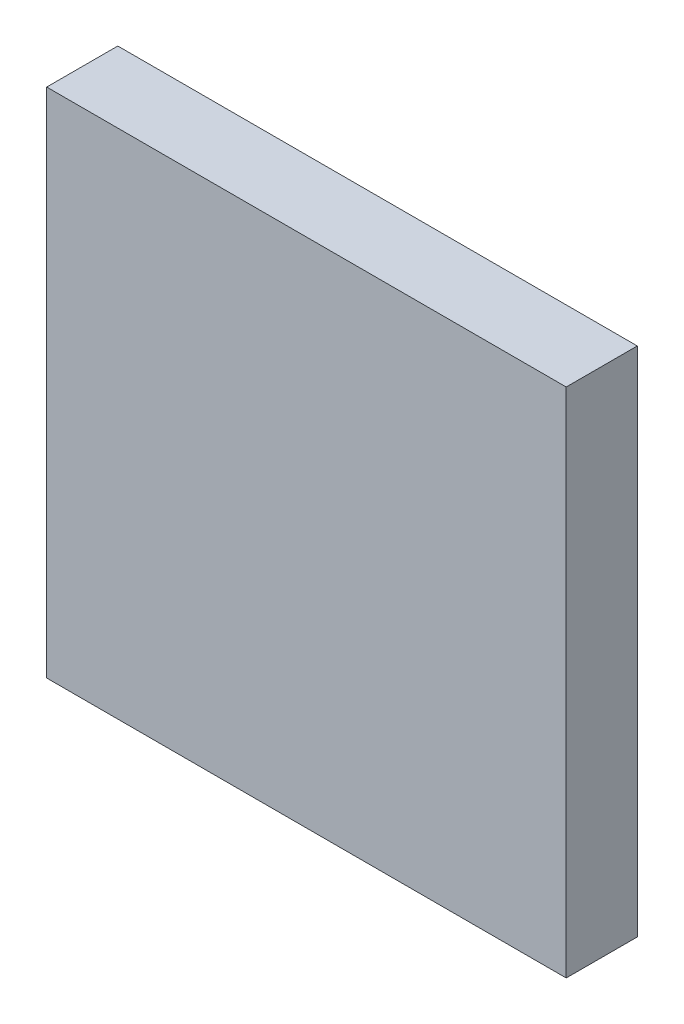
from build123d import *

# Parameters (mm, degrees)
SKETCH1_W           = 36.54
SKETCH1_H           = 36
BOSS_EXTRUDE1_DEPTH = 5


with BuildPart() as part:
    # Sketch1 → Boss-Extrude1 (new body)
    with BuildSketch(Plane.XY):
        with Locations((-8.550310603, -0.672814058)):
            Rectangle(SKETCH1_W, SKETCH1_H)
    extrude(amount=BOSS_EXTRUDE1_DEPTH)


solid = part.part
